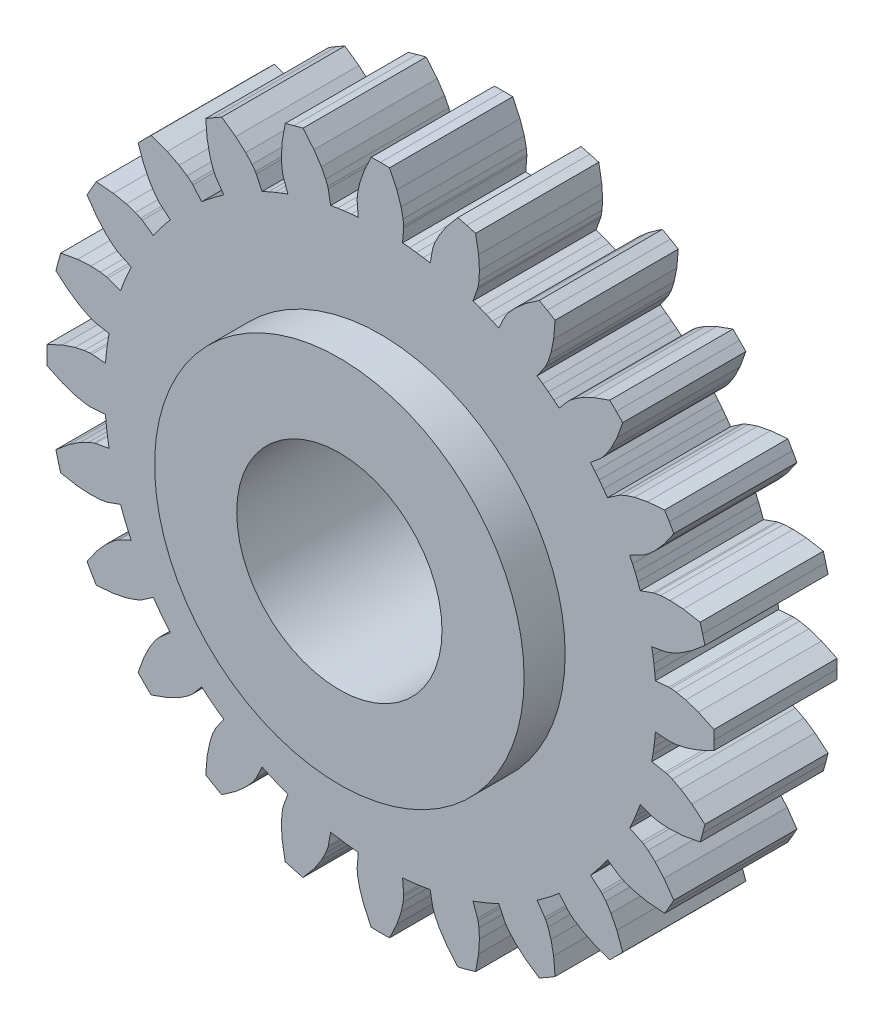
from build123d import *

# Parameters (mm, degrees)
SKETCH_1_R                         = 10
F_01_GEAR_BODY_Z24_M2_5_PA20_DEPTH = 6
SKETCH_2_R                         = 18
SKETCH_2_R_2                       = 10
F_02_HUB_D36_BORE_D20_DEPTH        = 10


with BuildPart() as part:
    # Sketch 1 → 01_GEAR_BODY_Z24_M2.5_PA20 (new, symmetric)
    with BuildSketch(Plane.XY):
        Polygon((26.788283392, -2.157196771), (28.099816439, -2.262811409), (28.285290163, -2.26352818), (28.838949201, -2.209028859), (29.745733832, -2.015469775), (30.976311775, -1.602282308), (32.487692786, -0.894325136), (32.5, 0), (32.487692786, 0.894325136), (30.976311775, 1.602282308), (29.745733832, 2.015469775), (28.838949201, 2.209028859), (28.285290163, 2.26352818), (28.099816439, 2.262811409), (26.788283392, 2.157196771), (26.725216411, 2.833448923), (26.645080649, 3.507891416), (26.547927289, 4.1800935), (26.433818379, 4.849625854), (27.727997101, 5.087059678), (27.907336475, 5.134371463), (28.428024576, 5.330311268), (29.253814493, 5.751968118), (30.335520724, 6.469573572), (31.612169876, 7.544581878), (31.392589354, 8.411618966), (31.149233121, 9.27228537), (29.50611837, 9.564945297), (28.210530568, 9.645556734), (27.284547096, 9.597827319), (26.73564807, 9.507172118), (26.556679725, 9.458475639), (25.317171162, 9.017010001), (25.0812262, 9.653896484), (24.829262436, 10.284617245), (24.561440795, 10.908769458), (24.277932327, 11.525954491), (25.466560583, 12.090256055), (25.627543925, 12.182372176), (26.079777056, 12.506399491), (26.76829604, 13.12741889), (27.627414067, 14.100538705), (28.582329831, 15.469338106), (28.145825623, 16.25), (27.688004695, 17.01835468), (26.025131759, 16.875773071), (24.752826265, 16.618314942), (23.870748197, 16.33254971), (23.364015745, 16.102917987), (23.203749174, 16.009560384), (22.120735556, 15.262328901), (21.727991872, 15.816446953), (21.32137102, 16.360463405), (20.9011327, 16.894030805), (20.467545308, 17.416808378), (21.469620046, 18.269521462), (21.601276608, 18.400164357), (21.954235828, 18.830197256), (22.458562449, 19.608257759), (23.036544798, 20.770575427), (23.604651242, 22.339884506), (22.980970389, 22.980970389), (22.339884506, 23.604651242), (20.770575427, 23.036544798), (19.608257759, 22.458562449), (18.830197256, 21.954235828), (18.400164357, 21.601276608), (18.269521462, 21.469620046), (17.416808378, 20.467545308), (16.894030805, 20.9011327), (16.360463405, 21.32137102), (15.816446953, 21.727991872), (15.262328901, 22.120735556), (16.009560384, 23.203749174), (16.102917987, 23.364015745), (16.33254971, 23.870748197), (16.618314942, 24.752826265), (16.875773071, 26.025131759), (17.01835468, 27.688004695), (16.25, 28.145825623), (15.469338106, 28.582329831), (14.100538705, 27.627414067), (13.12741889, 26.76829604), (12.506399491, 26.079777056), (12.182372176, 25.627543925), (12.090256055, 25.466560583), (11.525954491, 24.277932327), (10.908769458, 24.561440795), (10.284617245, 24.829262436), (9.653896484, 25.0812262), (9.017010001, 25.317171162), (9.458475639, 26.556679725), (9.507172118, 26.73564807), (9.597827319, 27.284547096), (9.645556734, 28.210530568), (9.564945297, 29.50611837), (9.27228537, 31.149233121), (8.411618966, 31.392589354), (7.544581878, 31.612169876), (6.469573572, 30.335520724), (5.751968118, 29.253814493), (5.330311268, 28.428024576), (5.134371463, 27.907336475), (5.087059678, 27.727997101), (4.849625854, 26.433818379), (4.1800935, 26.547927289), (3.507891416, 26.645080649), (2.833448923, 26.725216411), (2.157196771, 26.788283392), (2.262811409, 28.099816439), (2.26352818, 28.285290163), (2.209028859, 28.838949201), (2.015469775, 29.745733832), (1.602282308, 30.976311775), (0.894325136, 32.487692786), (0, 32.5), (-0.894325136, 32.487692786), (-1.602282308, 30.976311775), (-2.015469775, 29.745733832), (-2.209028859, 28.838949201), (-2.26352818, 28.285290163), (-2.262811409, 28.099816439), (-2.157196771, 26.788283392), (-2.833448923, 26.725216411), (-3.507891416, 26.645080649), (-4.1800935, 26.547927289), (-4.849625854, 26.433818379), (-5.087059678, 27.727997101), (-5.134371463, 27.907336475), (-5.330311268, 28.428024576), (-5.751968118, 29.253814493), (-6.469573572, 30.335520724), (-7.544581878, 31.612169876), (-8.411618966, 31.392589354), (-9.27228537, 31.149233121), (-9.564945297, 29.50611837), (-9.645556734, 28.210530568), (-9.597827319, 27.284547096), (-9.507172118, 26.73564807), (-9.458475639, 26.556679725), (-9.017010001, 25.317171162), (-9.653896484, 25.0812262), (-10.284617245, 24.829262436), (-10.908769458, 24.561440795), (-11.525954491, 24.277932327), (-12.090256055, 25.466560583), (-12.182372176, 25.627543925), (-12.506399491, 26.079777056), (-13.12741889, 26.76829604), (-14.100538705, 27.627414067), (-15.469338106, 28.582329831), (-16.25, 28.145825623), (-17.01835468, 27.688004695), (-16.875773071, 26.025131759), (-16.618314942, 24.752826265), (-16.33254971, 23.870748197), (-16.102917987, 23.364015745), (-16.009560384, 23.203749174), (-15.262328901, 22.120735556), (-15.816446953, 21.727991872), (-16.360463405, 21.32137102), (-16.894030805, 20.9011327), (-17.416808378, 20.467545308), (-18.269521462, 21.469620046), (-18.400164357, 21.601276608), (-18.830197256, 21.954235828), (-19.608257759, 22.458562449), (-20.770575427, 23.036544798), (-22.339884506, 23.604651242), (-22.980970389, 22.980970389), (-23.604651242, 22.339884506), (-23.036544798, 20.770575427), (-22.458562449, 19.608257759), (-21.954235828, 18.830197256), (-21.601276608, 18.400164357), (-21.469620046, 18.269521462), (-20.467545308, 17.416808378), (-20.9011327, 16.894030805), (-21.32137102, 16.360463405), (-21.727991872, 15.816446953), (-22.120735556, 15.262328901), (-23.203749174, 16.009560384), (-23.364015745, 16.102917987), (-23.870748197, 16.33254971), (-24.752826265, 16.618314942), (-26.025131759, 16.875773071), (-27.688004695, 17.01835468), (-28.145825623, 16.25), (-28.582329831, 15.469338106), (-27.627414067, 14.100538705), (-26.76829604, 13.12741889), (-26.079777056, 12.506399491), (-25.627543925, 12.182372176), (-25.466560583, 12.090256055), (-24.277932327, 11.525954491), (-24.561440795, 10.908769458), (-24.829262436, 10.284617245), (-25.0812262, 9.653896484), (-25.317171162, 9.017010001), (-26.556679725, 9.458475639), (-26.73564807, 9.507172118), (-27.284547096, 9.597827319), (-28.210530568, 9.645556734), (-29.50611837, 9.564945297), (-31.149233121, 9.27228537), (-31.392589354, 8.411618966), (-31.612169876, 7.544581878), (-30.335520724, 6.469573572), (-29.253814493, 5.751968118), (-28.428024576, 5.330311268), (-27.907336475, 5.134371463), (-27.727997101, 5.087059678), (-26.433818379, 4.849625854), (-26.547927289, 4.1800935), (-26.645080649, 3.507891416), (-26.725216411, 2.833448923), (-26.788283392, 2.157196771), (-28.099816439, 2.262811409), (-28.285290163, 2.26352818), (-28.838949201, 2.209028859), (-29.745733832, 2.015469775), (-30.976311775, 1.602282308), (-32.487692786, 0.894325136), (-32.5, 0), (-32.487692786, -0.894325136), (-30.976311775, -1.602282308), (-29.745733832, -2.015469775), (-28.838949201, -2.209028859), (-28.285290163, -2.26352818), (-28.099816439, -2.262811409), (-26.788283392, -2.157196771), (-26.725216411, -2.833448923), (-26.645080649, -3.507891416), (-26.547927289, -4.1800935), (-26.433818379, -4.849625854), (-27.727997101, -5.087059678), (-27.907336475, -5.134371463), (-28.428024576, -5.330311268), (-29.253814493, -5.751968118), (-30.335520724, -6.469573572), (-31.612169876, -7.544581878), (-31.392589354, -8.411618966), (-31.149233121, -9.27228537), (-29.50611837, -9.564945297), (-28.210530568, -9.645556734), (-27.284547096, -9.597827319), (-26.73564807, -9.507172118), (-26.556679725, -9.458475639), (-25.317171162, -9.017010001), (-25.0812262, -9.653896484), (-24.829262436, -10.284617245), (-24.561440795, -10.908769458), (-24.277932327, -11.525954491), (-25.466560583, -12.090256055), (-25.627543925, -12.182372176), (-26.079777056, -12.506399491), (-26.76829604, -13.12741889), (-27.627414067, -14.100538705), (-28.582329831, -15.469338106), (-28.145825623, -16.25), (-27.688004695, -17.01835468), (-26.025131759, -16.875773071), (-24.752826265, -16.618314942), (-23.870748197, -16.33254971), (-23.364015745, -16.102917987), (-23.203749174, -16.009560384), (-22.120735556, -15.262328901), (-21.727991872, -15.816446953), (-21.32137102, -16.360463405), (-20.9011327, -16.894030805), (-20.467545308, -17.416808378), (-21.469620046, -18.269521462), (-21.601276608, -18.400164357), (-21.954235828, -18.830197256), (-22.458562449, -19.608257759), (-23.036544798, -20.770575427), (-23.604651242, -22.339884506), (-22.980970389, -22.980970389), (-22.339884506, -23.604651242), (-20.770575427, -23.036544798), (-19.608257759, -22.458562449), (-18.830197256, -21.954235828), (-18.400164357, -21.601276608), (-18.269521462, -21.469620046), (-17.416808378, -20.467545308), (-16.894030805, -20.9011327), (-16.360463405, -21.32137102), (-15.816446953, -21.727991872), (-15.262328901, -22.120735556), (-16.009560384, -23.203749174), (-16.102917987, -23.364015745), (-16.33254971, -23.870748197), (-16.618314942, -24.752826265), (-16.875773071, -26.025131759), (-17.01835468, -27.688004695), (-16.25, -28.145825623), (-15.469338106, -28.582329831), (-14.100538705, -27.627414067), (-13.12741889, -26.76829604), (-12.506399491, -26.079777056), (-12.182372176, -25.627543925), (-12.090256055, -25.466560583), (-11.525954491, -24.277932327), (-10.908769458, -24.561440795), (-10.284617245, -24.829262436), (-9.653896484, -25.0812262), (-9.017010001, -25.317171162), (-9.458475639, -26.556679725), (-9.507172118, -26.73564807), (-9.597827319, -27.284547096), (-9.645556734, -28.210530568), (-9.564945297, -29.50611837), (-9.27228537, -31.149233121), (-8.411618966, -31.392589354), (-7.544581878, -31.612169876), (-6.469573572, -30.335520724), (-5.751968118, -29.253814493), (-5.330311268, -28.428024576), (-5.134371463, -27.907336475), (-5.087059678, -27.727997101), (-4.849625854, -26.433818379), (-4.1800935, -26.547927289), (-3.507891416, -26.645080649), (-2.833448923, -26.725216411), (-2.157196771, -26.788283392), (-2.262811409, -28.099816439), (-2.26352818, -28.285290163), (-2.209028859, -28.838949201), (-2.015469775, -29.745733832), (-1.602282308, -30.976311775), (-0.894325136, -32.487692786), (0, -32.5), (0.894325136, -32.487692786), (1.602282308, -30.976311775), (2.015469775, -29.745733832), (2.209028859, -28.838949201), (2.26352818, -28.285290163), (2.262811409, -28.099816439), (2.157196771, -26.788283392), (2.833448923, -26.725216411), (3.507891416, -26.645080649), (4.1800935, -26.547927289), (4.849625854, -26.433818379), (5.087059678, -27.727997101), (5.134371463, -27.907336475), (5.330311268, -28.428024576), (5.751968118, -29.253814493), (6.469573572, -30.335520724), (7.544581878, -31.612169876), (8.411618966, -31.392589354), (9.27228537, -31.149233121), (9.564945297, -29.50611837), (9.645556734, -28.210530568), (9.597827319, -27.284547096), (9.507172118, -26.73564807), (9.458475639, -26.556679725), (9.017010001, -25.317171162), (9.653896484, -25.0812262), (10.284617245, -24.829262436), (10.908769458, -24.561440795), (11.525954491, -24.277932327), (12.090256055, -25.466560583), (12.182372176, -25.627543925), (12.506399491, -26.079777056), (13.12741889, -26.76829604), (14.100538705, -27.627414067), (15.469338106, -28.582329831), (16.25, -28.145825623), (17.01835468, -27.688004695), (16.875773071, -26.025131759), (16.618314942, -24.752826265), (16.33254971, -23.870748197), (16.102917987, -23.364015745), (16.009560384, -23.203749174), (15.262328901, -22.120735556), (15.816446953, -21.727991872), (16.360463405, -21.32137102), (16.894030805, -20.9011327), (17.416808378, -20.467545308), (18.269521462, -21.469620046), (18.400164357, -21.601276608), (18.830197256, -21.954235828), (19.608257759, -22.458562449), (20.770575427, -23.036544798), (22.339884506, -23.604651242), (22.980970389, -22.980970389), (23.604651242, -22.339884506), (23.036544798, -20.770575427), (22.458562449, -19.608257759), (21.954235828, -18.830197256), (21.601276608, -18.400164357), (21.469620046, -18.269521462), (20.467545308, -17.416808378), (20.9011327, -16.894030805), (21.32137102, -16.360463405), (21.727991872, -15.816446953), (22.120735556, -15.262328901), (23.203749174, -16.009560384), (23.364015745, -16.102917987), (23.870748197, -16.33254971), (24.752826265, -16.618314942), (26.025131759, -16.875773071), (27.688004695, -17.01835468), (28.145825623, -16.25), (28.582329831, -15.469338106), (27.627414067, -14.100538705), (26.76829604, -13.12741889), (26.079777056, -12.506399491), (25.627543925, -12.182372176), (25.466560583, -12.090256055), (24.277932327, -11.525954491), (24.561440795, -10.908769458), (24.829262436, -10.284617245), (25.0812262, -9.653896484), (25.317171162, -9.017010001), (26.556679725, -9.458475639), (26.73564807, -9.507172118), (27.284547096, -9.597827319), (28.210530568, -9.645556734), (29.50611837, -9.564945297), (31.149233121, -9.27228537), (31.392589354, -8.411618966), (31.612169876, -7.544581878), (30.335520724, -6.469573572), (29.253814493, -5.751968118), (28.428024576, -5.330311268), (27.907336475, -5.134371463), (27.727997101, -5.087059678), (26.433818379, -4.849625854), (26.547927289, -4.1800935), (26.645080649, -3.507891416), (26.725216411, -2.833448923), align=None)
        Circle(SKETCH_1_R, mode=Mode.SUBTRACT)
    extrude(amount=F_01_GEAR_BODY_Z24_M2_5_PA20_DEPTH, both=True)

    # Sketch 2 → 02_HUB_D36_BORE_D20 (add, symmetric)
    with BuildSketch(Plane.XY):
        Circle(SKETCH_2_R)
        Circle(SKETCH_2_R_2, mode=Mode.SUBTRACT)
    extrude(amount=F_02_HUB_D36_BORE_D20_DEPTH, both=True)


solid = part.part
